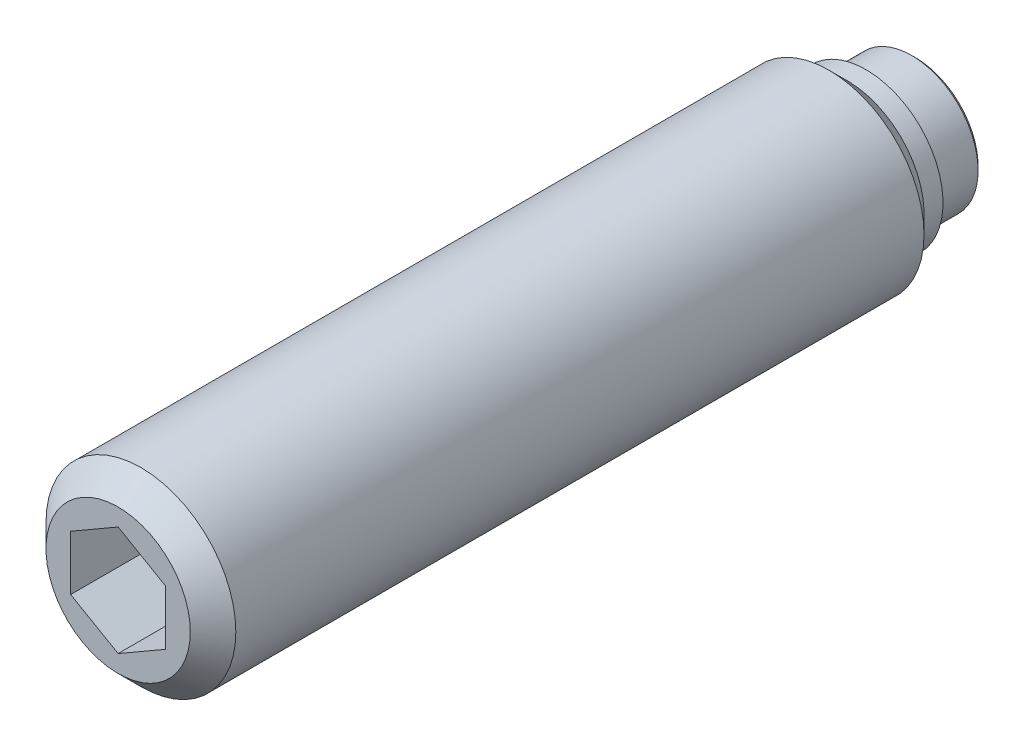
ISO-10303-21;
HEADER;
FILE_DESCRIPTION(('STEP AP214'),'2;1');
FILE_NAME('part.step','',(''),(''),'','','');
FILE_SCHEMA(('AUTOMOTIVE_DESIGN { 1 0 10303 214 1 1 1 1 }'));
ENDSEC;
DATA;
#1=APPLICATION_CONTEXT('core data for automotive mechanical design processes');
#2=APPLICATION_PROTOCOL_DEFINITION('international standard','automotive_design',2000,#1);
#3=PRODUCT_CONTEXT('',#1,'mechanical');
#4=PRODUCT('Part','Part','',(#3));
#5=PRODUCT_RELATED_PRODUCT_CATEGORY('part','',(#4));
#6=PRODUCT_DEFINITION_FORMATION('','',#4);
#7=PRODUCT_DEFINITION_CONTEXT('part definition',#1,'design');
#8=PRODUCT_DEFINITION('design','',#6,#7);
#9=PRODUCT_DEFINITION_SHAPE('','',#8);
#10=(LENGTH_UNIT() NAMED_UNIT(*) SI_UNIT(.MILLI.,.METRE.));
#11=(NAMED_UNIT(*) PLANE_ANGLE_UNIT() SI_UNIT($,.RADIAN.));
#12=(NAMED_UNIT(*) SI_UNIT($,.STERADIAN.) SOLID_ANGLE_UNIT());
#13=UNCERTAINTY_MEASURE_WITH_UNIT(LENGTH_MEASURE(1.E-05),#10,'distance_accuracy_value','');
#14=(GEOMETRIC_REPRESENTATION_CONTEXT(3) GLOBAL_UNCERTAINTY_ASSIGNED_CONTEXT((#13)) GLOBAL_UNIT_ASSIGNED_CONTEXT((#10,
#11,#12)) REPRESENTATION_CONTEXT('',''));
#15=CARTESIAN_POINT('',(0.,0.,0.));
#16=DIRECTION('',(0.,0.,1.));
#17=DIRECTION('',(1.,0.,0.));
#18=AXIS2_PLACEMENT_3D('',#15,#16,#17);
#19=CARTESIAN_POINT('',(0.,4.05,2.6));
#20=DIRECTION('',(0.,0.,1.));
#21=DIRECTION('',(1.,0.,0.));
#22=AXIS2_PLACEMENT_3D('',#19,#20,#21);
#23=PLANE('',#22);
#24=CARTESIAN_POINT('',(0.,0.,2.6));
#25=DIRECTION('',(0.,0.,-1.));
#26=DIRECTION('',(-1.,0.,0.));
#27=AXIS2_PLACEMENT_3D('',#24,#25,#26);
#28=CIRCLE('',#27,3.5);
#29=CARTESIAN_POINT('',(-3.5,0.,2.6));
#30=VERTEX_POINT('',#29);
#31=EDGE_CURVE('E130',#30,#30,#28,.T.);
#32=ORIENTED_EDGE('',*,*,#31,.F.);
#33=EDGE_LOOP('',(#32));
#34=FACE_BOUND('',#33,.T.);
#35=CARTESIAN_POINT('',(0.,0.,2.6));
#36=DIRECTION('',(0.,0.,-1.));
#37=DIRECTION('',(-1.,0.,0.));
#38=AXIS2_PLACEMENT_3D('',#35,#36,#37);
#39=CIRCLE('',#38,4.05);
#40=CARTESIAN_POINT('',(-4.05,0.,2.6));
#41=VERTEX_POINT('',#40);
#42=EDGE_CURVE('E133',#41,#41,#39,.T.);
#43=ORIENTED_EDGE('',*,*,#42,.T.);
#44=EDGE_LOOP('',(#43));
#45=FACE_BOUND('',#44,.T.);
#46=ADVANCED_FACE('F14',(#34,#45),#23,.F.);
#47=CARTESIAN_POINT('',(0.,0.,2.6));
#48=DIRECTION('',(0.,0.,-1.));
#49=DIRECTION('',(-1.,0.,0.));
#50=AXIS2_PLACEMENT_3D('',#47,#48,#49);
#51=CYLINDRICAL_SURFACE('',#50,5.);
#52=CARTESIAN_POINT('',(0.,0.,40.8));
#53=DIRECTION('',(0.,0.,1.));
#54=DIRECTION('',(1.,0.,0.));
#55=AXIS2_PLACEMENT_3D('',#52,#53,#54);
#56=CIRCLE('',#55,5.);
#57=CARTESIAN_POINT('',(5.,0.,40.8));
#58=VERTEX_POINT('',#57);
#59=EDGE_CURVE('E9',#58,#58,#56,.F.);
#60=ORIENTED_EDGE('',*,*,#59,.T.);
#61=EDGE_LOOP('',(#60));
#62=FACE_BOUND('',#61,.T.);
#63=CARTESIAN_POINT('',(0.,0.,4.55));
#64=DIRECTION('',(0.,0.,-1.));
#65=DIRECTION('',(-1.,0.,0.));
#66=AXIS2_PLACEMENT_3D('',#63,#64,#65);
#67=CIRCLE('',#66,5.);
#68=CARTESIAN_POINT('',(-5.,0.,4.55));
#69=VERTEX_POINT('',#68);
#70=EDGE_CURVE('E139',#69,#69,#67,.T.);
#71=ORIENTED_EDGE('',*,*,#70,.F.);
#72=EDGE_LOOP('',(#71));
#73=FACE_BOUND('',#72,.T.);
#74=ADVANCED_FACE('F157',(#62,#73),#51,.T.);
#75=CARTESIAN_POINT('',(0.,0.,4.55));
#76=DIRECTION('',(0.,0.,1.));
#77=DIRECTION('',(1.,0.,0.));
#78=AXIS2_PLACEMENT_3D('',#75,#76,#77);
#79=CONICAL_SURFACE('',#78,5.,0.785398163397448);
#80=CARTESIAN_POINT('',(0.,0.,3.6));
#81=DIRECTION('',(0.,0.,-1.));
#82=DIRECTION('',(-1.,0.,0.));
#83=AXIS2_PLACEMENT_3D('',#80,#81,#82);
#84=CIRCLE('',#83,4.05);
#85=CARTESIAN_POINT('',(-4.05,0.,3.6));
#86=VERTEX_POINT('',#85);
#87=EDGE_CURVE('E136',#86,#86,#84,.T.);
#88=ORIENTED_EDGE('',*,*,#87,.F.);
#89=EDGE_LOOP('',(#88));
#90=FACE_BOUND('',#89,.T.);
#91=ORIENTED_EDGE('',*,*,#70,.T.);
#92=EDGE_LOOP('',(#91));
#93=FACE_BOUND('',#92,.T.);
#94=ADVANCED_FACE('F164',(#90,#93),#79,.T.);
#95=CARTESIAN_POINT('',(0.,0.,2.6));
#96=DIRECTION('',(0.,0.,-1.));
#97=DIRECTION('',(-1.,0.,0.));
#98=AXIS2_PLACEMENT_3D('',#95,#96,#97);
#99=CYLINDRICAL_SURFACE('',#98,4.05);
#100=ORIENTED_EDGE('',*,*,#42,.F.);
#101=EDGE_LOOP('',(#100));
#102=FACE_BOUND('',#101,.T.);
#103=ORIENTED_EDGE('',*,*,#87,.T.);
#104=EDGE_LOOP('',(#103));
#105=FACE_BOUND('',#104,.T.);
#106=ADVANCED_FACE('F172',(#102,#105),#99,.T.);
#107=CARTESIAN_POINT('',(0.,0.,-1.5));
#108=DIRECTION('',(0.,0.,-1.));
#109=DIRECTION('',(-1.,0.,0.));
#110=AXIS2_PLACEMENT_3D('',#107,#108,#109);
#111=CYLINDRICAL_SURFACE('',#110,3.5);
#112=CARTESIAN_POINT('',(0.,0.,0.2));
#113=DIRECTION('',(0.,0.,-1.));
#114=DIRECTION('',(-1.,0.,0.));
#115=AXIS2_PLACEMENT_3D('',#112,#113,#114);
#116=CIRCLE('',#115,3.5);
#117=CARTESIAN_POINT('',(-3.5,0.,0.2));
#118=VERTEX_POINT('',#117);
#119=EDGE_CURVE('E127',#118,#118,#116,.T.);
#120=ORIENTED_EDGE('',*,*,#119,.F.);
#121=EDGE_LOOP('',(#120));
#122=FACE_BOUND('',#121,.T.);
#123=ORIENTED_EDGE('',*,*,#31,.T.);
#124=EDGE_LOOP('',(#123));
#125=FACE_BOUND('',#124,.T.);
#126=ADVANCED_FACE('F170',(#122,#125),#111,.T.);
#127=CARTESIAN_POINT('',(0.,0.,0.2));
#128=DIRECTION('',(0.,0.,1.));
#129=DIRECTION('',(1.,0.,0.));
#130=AXIS2_PLACEMENT_3D('',#127,#128,#129);
#131=CONICAL_SURFACE('',#130,3.5,0.785398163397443);
#132=CARTESIAN_POINT('',(0.,0.,0.));
#133=DIRECTION('',(0.,0.,-1.));
#134=DIRECTION('',(-1.,0.,0.));
#135=AXIS2_PLACEMENT_3D('',#132,#133,#134);
#136=CIRCLE('',#135,3.3);
#137=CARTESIAN_POINT('',(-3.3,0.,0.));
#138=VERTEX_POINT('',#137);
#139=EDGE_CURVE('E124',#138,#138,#136,.T.);
#140=ORIENTED_EDGE('',*,*,#139,.F.);
#141=EDGE_LOOP('',(#140));
#142=FACE_BOUND('',#141,.T.);
#143=ORIENTED_EDGE('',*,*,#119,.T.);
#144=EDGE_LOOP('',(#143));
#145=FACE_BOUND('',#144,.T.);
#146=ADVANCED_FACE('F204',(#142,#145),#131,.T.);
#147=CARTESIAN_POINT('',(0.,3.3,0.));
#148=DIRECTION('',(0.,0.,1.));
#149=DIRECTION('',(1.,0.,0.));
#150=AXIS2_PLACEMENT_3D('',#147,#148,#149);
#151=PLANE('',#150);
#152=CARTESIAN_POINT('',(0.,0.,0.));
#153=DIRECTION('',(0.,0.,-1.));
#154=DIRECTION('',(-1.,0.,0.));
#155=AXIS2_PLACEMENT_3D('',#152,#153,#154);
#156=CIRCLE('',#155,1.5);
#157=CARTESIAN_POINT('',(-1.5,0.,0.));
#158=VERTEX_POINT('',#157);
#159=EDGE_CURVE('E114',#158,#158,#156,.T.);
#160=ORIENTED_EDGE('',*,*,#159,.F.);
#161=EDGE_LOOP('',(#160));
#162=FACE_BOUND('',#161,.T.);
#163=ORIENTED_EDGE('',*,*,#139,.T.);
#164=EDGE_LOOP('',(#163));
#165=FACE_BOUND('',#164,.T.);
#166=ADVANCED_FACE('F212',(#162,#165),#151,.F.);
#167=CARTESIAN_POINT('',(0.,0.,0.));
#168=DIRECTION('',(0.,0.,1.));
#169=DIRECTION('',(1.,0.,0.));
#170=AXIS2_PLACEMENT_3D('',#167,#168,#169);
#171=CONICAL_SURFACE('',#170,1.5,0.785398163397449);
#172=CARTESIAN_POINT('',(0.,0.,-1.5));
#173=VERTEX_POINT('',#172);
#174=VERTEX_LOOP('',#173);
#175=FACE_BOUND('',#174,.T.);
#176=ORIENTED_EDGE('',*,*,#159,.T.);
#177=EDGE_LOOP('',(#176));
#178=FACE_BOUND('',#177,.T.);
#179=ADVANCED_FACE('F220',(#175,#178),#171,.T.);
#180=CARTESIAN_POINT('',(0.,0.,42.));
#181=DIRECTION('',(0.,0.,1.));
#182=DIRECTION('',(1.,0.,0.));
#183=AXIS2_PLACEMENT_3D('',#180,#181,#182);
#184=PLANE('',#183);
#185=CARTESIAN_POINT('',(0.,0.,42.));
#186=DIRECTION('',(0.,0.,1.));
#187=DIRECTION('',(1.,0.,0.));
#188=AXIS2_PLACEMENT_3D('',#185,#186,#187);
#189=CIRCLE('',#188,3.8);
#190=CARTESIAN_POINT('',(3.8,0.,42.));
#191=VERTEX_POINT('',#190);
#192=EDGE_CURVE('E22',#191,#191,#189,.T.);
#193=ORIENTED_EDGE('',*,*,#192,.T.);
#194=EDGE_LOOP('',(#193));
#195=FACE_BOUND('',#194,.T.);
#196=DIRECTION('',(-0.866025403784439,0.5,0.));
#197=VECTOR('',#196,1.);
#198=CARTESIAN_POINT('',(2.5,1.44337567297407,42.));
#199=LINE('',#198,#197);
#200=CARTESIAN_POINT('',(2.5,1.44337567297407,42.));
#201=VERTEX_POINT('',#200);
#202=CARTESIAN_POINT('',(0.,2.88675134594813,42.));
#203=VERTEX_POINT('',#202);
#204=EDGE_CURVE('E29',#201,#203,#199,.T.);
#205=ORIENTED_EDGE('',*,*,#204,.F.);
#206=DIRECTION('',(0.,1.,0.));
#207=VECTOR('',#206,1.);
#208=CARTESIAN_POINT('',(2.5,-1.44337567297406,42.));
#209=LINE('',#208,#207);
#210=CARTESIAN_POINT('',(2.5,-1.44337567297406,42.));
#211=VERTEX_POINT('',#210);
#212=EDGE_CURVE('E88',#211,#201,#209,.T.);
#213=ORIENTED_EDGE('',*,*,#212,.F.);
#214=DIRECTION('',(0.866025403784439,0.5,0.));
#215=VECTOR('',#214,1.);
#216=CARTESIAN_POINT('',(0.,-2.88675134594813,42.));
#217=LINE('',#216,#215);
#218=CARTESIAN_POINT('',(0.,-2.88675134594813,42.));
#219=VERTEX_POINT('',#218);
#220=EDGE_CURVE('E91',#219,#211,#217,.T.);
#221=ORIENTED_EDGE('',*,*,#220,.F.);
#222=DIRECTION('',(0.866025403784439,-0.5,0.));
#223=VECTOR('',#222,1.);
#224=CARTESIAN_POINT('',(-2.5,-1.44337567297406,42.));
#225=LINE('',#224,#223);
#226=CARTESIAN_POINT('',(-2.5,-1.44337567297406,42.));
#227=VERTEX_POINT('',#226);
#228=EDGE_CURVE('E107',#227,#219,#225,.T.);
#229=ORIENTED_EDGE('',*,*,#228,.F.);
#230=DIRECTION('',(0.,-1.,0.));
#231=VECTOR('',#230,1.);
#232=CARTESIAN_POINT('',(-2.5,1.44337567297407,42.));
#233=LINE('',#232,#231);
#234=CARTESIAN_POINT('',(-2.5,1.44337567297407,42.));
#235=VERTEX_POINT('',#234);
#236=EDGE_CURVE('E104',#235,#227,#233,.T.);
#237=ORIENTED_EDGE('',*,*,#236,.F.);
#238=DIRECTION('',(-0.866025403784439,-0.5,0.));
#239=VECTOR('',#238,1.);
#240=CARTESIAN_POINT('',(0.,2.88675134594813,42.));
#241=LINE('',#240,#239);
#242=EDGE_CURVE('E102',#203,#235,#241,.T.);
#243=ORIENTED_EDGE('',*,*,#242,.F.);
#244=EDGE_LOOP('',(#205,#213,#221,#229,#237,#243));
#245=FACE_BOUND('',#244,.T.);
#246=ADVANCED_FACE('F144',(#195,#245),#184,.T.);
#247=CARTESIAN_POINT('',(2.5,1.44337567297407,36.));
#248=DIRECTION('',(0.5,0.866025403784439,0.));
#249=DIRECTION('',(-0.866025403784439,0.5,0.));
#250=AXIS2_PLACEMENT_3D('',#247,#248,#249);
#251=PLANE('',#250);
#252=ORIENTED_EDGE('',*,*,#204,.T.);
#253=DIRECTION('',(0.,0.,1.));
#254=VECTOR('',#253,1.);
#255=CARTESIAN_POINT('',(0.,2.88675134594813,36.));
#256=LINE('',#255,#254);
#257=CARTESIAN_POINT('',(0.,2.88675134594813,36.));
#258=VERTEX_POINT('',#257);
#259=EDGE_CURVE('E65',#258,#203,#256,.T.);
#260=ORIENTED_EDGE('',*,*,#259,.F.);
#261=DIRECTION('',(-0.866025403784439,0.5,0.));
#262=VECTOR('',#261,1.);
#263=CARTESIAN_POINT('',(2.5,1.44337567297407,36.));
#264=LINE('',#263,#262);
#265=CARTESIAN_POINT('',(2.5,1.44337567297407,36.));
#266=VERTEX_POINT('',#265);
#267=EDGE_CURVE('E69',#266,#258,#264,.T.);
#268=ORIENTED_EDGE('',*,*,#267,.F.);
#269=DIRECTION('',(0.,0.,1.));
#270=VECTOR('',#269,1.);
#271=CARTESIAN_POINT('',(2.5,1.44337567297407,36.));
#272=LINE('',#271,#270);
#273=EDGE_CURVE('E112',#266,#201,#272,.T.);
#274=ORIENTED_EDGE('',*,*,#273,.T.);
#275=EDGE_LOOP('',(#252,#260,#268,#274));
#276=FACE_BOUND('',#275,.T.);
#277=ADVANCED_FACE('F67',(#276),#251,.F.);
#278=CARTESIAN_POINT('',(2.5,-1.44337567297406,36.));
#279=DIRECTION('',(1.,0.,0.));
#280=DIRECTION('',(0.,0.,-1.));
#281=AXIS2_PLACEMENT_3D('',#278,#279,#280);
#282=PLANE('',#281);
#283=ORIENTED_EDGE('',*,*,#212,.T.);
#284=ORIENTED_EDGE('',*,*,#273,.F.);
#285=DIRECTION('',(0.,1.,0.));
#286=VECTOR('',#285,1.);
#287=CARTESIAN_POINT('',(2.5,-1.44337567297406,36.));
#288=LINE('',#287,#286);
#289=CARTESIAN_POINT('',(2.5,-1.44337567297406,36.));
#290=VERTEX_POINT('',#289);
#291=EDGE_CURVE('E75',#290,#266,#288,.T.);
#292=ORIENTED_EDGE('',*,*,#291,.F.);
#293=DIRECTION('',(0.,0.,1.));
#294=VECTOR('',#293,1.);
#295=CARTESIAN_POINT('',(2.5,-1.44337567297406,36.));
#296=LINE('',#295,#294);
#297=EDGE_CURVE('E115',#290,#211,#296,.T.);
#298=ORIENTED_EDGE('',*,*,#297,.T.);
#299=EDGE_LOOP('',(#283,#284,#292,#298));
#300=FACE_BOUND('',#299,.T.);
#301=ADVANCED_FACE('F243',(#300),#282,.F.);
#302=CARTESIAN_POINT('',(0.,-2.88675134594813,36.));
#303=DIRECTION('',(0.5,-0.866025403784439,0.));
#304=DIRECTION('',(0.866025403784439,0.5,0.));
#305=AXIS2_PLACEMENT_3D('',#302,#303,#304);
#306=PLANE('',#305);
#307=ORIENTED_EDGE('',*,*,#220,.T.);
#308=ORIENTED_EDGE('',*,*,#297,.F.);
#309=DIRECTION('',(0.866025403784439,0.5,0.));
#310=VECTOR('',#309,1.);
#311=CARTESIAN_POINT('',(0.,-2.88675134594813,36.));
#312=LINE('',#311,#310);
#313=CARTESIAN_POINT('',(0.,-2.88675134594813,36.));
#314=VERTEX_POINT('',#313);
#315=EDGE_CURVE('E98',#314,#290,#312,.T.);
#316=ORIENTED_EDGE('',*,*,#315,.F.);
#317=DIRECTION('',(0.,0.,1.));
#318=VECTOR('',#317,1.);
#319=CARTESIAN_POINT('',(0.,-2.88675134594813,36.));
#320=LINE('',#319,#318);
#321=EDGE_CURVE('E117',#314,#219,#320,.T.);
#322=ORIENTED_EDGE('',*,*,#321,.T.);
#323=EDGE_LOOP('',(#307,#308,#316,#322));
#324=FACE_BOUND('',#323,.T.);
#325=ADVANCED_FACE('F251',(#324),#306,.F.);
#326=CARTESIAN_POINT('',(-2.5,-1.44337567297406,36.));
#327=DIRECTION('',(-0.5,-0.866025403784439,0.));
#328=DIRECTION('',(0.866025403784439,-0.5,0.));
#329=AXIS2_PLACEMENT_3D('',#326,#327,#328);
#330=PLANE('',#329);
#331=ORIENTED_EDGE('',*,*,#228,.T.);
#332=ORIENTED_EDGE('',*,*,#321,.F.);
#333=DIRECTION('',(0.866025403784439,-0.5,0.));
#334=VECTOR('',#333,1.);
#335=CARTESIAN_POINT('',(-2.5,-1.44337567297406,36.));
#336=LINE('',#335,#334);
#337=CARTESIAN_POINT('',(-2.5,-1.44337567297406,36.));
#338=VERTEX_POINT('',#337);
#339=EDGE_CURVE('E95',#338,#314,#336,.T.);
#340=ORIENTED_EDGE('',*,*,#339,.F.);
#341=DIRECTION('',(0.,0.,1.));
#342=VECTOR('',#341,1.);
#343=CARTESIAN_POINT('',(-2.5,-1.44337567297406,36.));
#344=LINE('',#343,#342);
#345=EDGE_CURVE('E119',#338,#227,#344,.T.);
#346=ORIENTED_EDGE('',*,*,#345,.T.);
#347=EDGE_LOOP('',(#331,#332,#340,#346));
#348=FACE_BOUND('',#347,.T.);
#349=ADVANCED_FACE('F260',(#348),#330,.F.);
#350=CARTESIAN_POINT('',(-2.5,1.44337567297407,36.));
#351=DIRECTION('',(-1.,0.,0.));
#352=DIRECTION('',(0.,-1.,0.));
#353=AXIS2_PLACEMENT_3D('',#350,#351,#352);
#354=PLANE('',#353);
#355=ORIENTED_EDGE('',*,*,#236,.T.);
#356=ORIENTED_EDGE('',*,*,#345,.F.);
#357=DIRECTION('',(0.,-1.,0.));
#358=VECTOR('',#357,1.);
#359=CARTESIAN_POINT('',(-2.5,1.44337567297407,36.));
#360=LINE('',#359,#358);
#361=CARTESIAN_POINT('',(-2.5,1.44337567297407,36.));
#362=VERTEX_POINT('',#361);
#363=EDGE_CURVE('E83',#362,#338,#360,.T.);
#364=ORIENTED_EDGE('',*,*,#363,.F.);
#365=DIRECTION('',(0.,0.,1.));
#366=VECTOR('',#365,1.);
#367=CARTESIAN_POINT('',(-2.5,1.44337567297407,36.));
#368=LINE('',#367,#366);
#369=EDGE_CURVE('E74',#362,#235,#368,.T.);
#370=ORIENTED_EDGE('',*,*,#369,.T.);
#371=EDGE_LOOP('',(#355,#356,#364,#370));
#372=FACE_BOUND('',#371,.T.);
#373=ADVANCED_FACE('F269',(#372),#354,.F.);
#374=CARTESIAN_POINT('',(0.,2.88675134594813,36.));
#375=DIRECTION('',(-0.5,0.866025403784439,0.));
#376=DIRECTION('',(-0.866025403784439,-0.5,0.));
#377=AXIS2_PLACEMENT_3D('',#374,#375,#376);
#378=PLANE('',#377);
#379=ORIENTED_EDGE('',*,*,#242,.T.);
#380=ORIENTED_EDGE('',*,*,#369,.F.);
#381=DIRECTION('',(-0.866025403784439,-0.5,0.));
#382=VECTOR('',#381,1.);
#383=CARTESIAN_POINT('',(0.,2.88675134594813,36.));
#384=LINE('',#383,#382);
#385=EDGE_CURVE('E78',#258,#362,#384,.T.);
#386=ORIENTED_EDGE('',*,*,#385,.F.);
#387=ORIENTED_EDGE('',*,*,#259,.T.);
#388=EDGE_LOOP('',(#379,#380,#386,#387));
#389=FACE_BOUND('',#388,.T.);
#390=ADVANCED_FACE('F79',(#389),#378,.F.);
#391=CARTESIAN_POINT('',(0.,0.,36.));
#392=DIRECTION('',(0.,0.,1.));
#393=DIRECTION('',(1.,0.,0.));
#394=AXIS2_PLACEMENT_3D('',#391,#392,#393);
#395=PLANE('',#394);
#396=ORIENTED_EDGE('',*,*,#267,.T.);
#397=ORIENTED_EDGE('',*,*,#385,.T.);
#398=ORIENTED_EDGE('',*,*,#363,.T.);
#399=ORIENTED_EDGE('',*,*,#339,.T.);
#400=ORIENTED_EDGE('',*,*,#315,.T.);
#401=ORIENTED_EDGE('',*,*,#291,.T.);
#402=EDGE_LOOP('',(#396,#397,#398,#399,#400,#401));
#403=FACE_BOUND('',#402,.T.);
#404=ADVANCED_FACE('F85',(#403),#395,.T.);
#405=CARTESIAN_POINT('',(0.,0.,42.));
#406=DIRECTION('',(0.,0.,-1.));
#407=DIRECTION('',(-1.,0.,0.));
#408=AXIS2_PLACEMENT_3D('',#405,#406,#407);
#409=CONICAL_SURFACE('',#408,3.8,0.785398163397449);
#410=ORIENTED_EDGE('',*,*,#59,.F.);
#411=EDGE_LOOP('',(#410));
#412=FACE_BOUND('',#411,.T.);
#413=ORIENTED_EDGE('',*,*,#192,.F.);
#414=EDGE_LOOP('',(#413));
#415=FACE_BOUND('',#414,.T.);
#416=ADVANCED_FACE('F16',(#412,#415),#409,.T.);
#417=CLOSED_SHELL('',(#46,#74,#94,#106,#126,#146,#166,#179,#246,#277,#301,#325,#349,#373,#390,
#404,#416));
#418=MANIFOLD_SOLID_BREP('B1',#417);
#419=ADVANCED_BREP_SHAPE_REPRESENTATION('',(#18,#418),#14);
#420=SHAPE_DEFINITION_REPRESENTATION(#9,#419);
ENDSEC;
END-ISO-10303-21;
